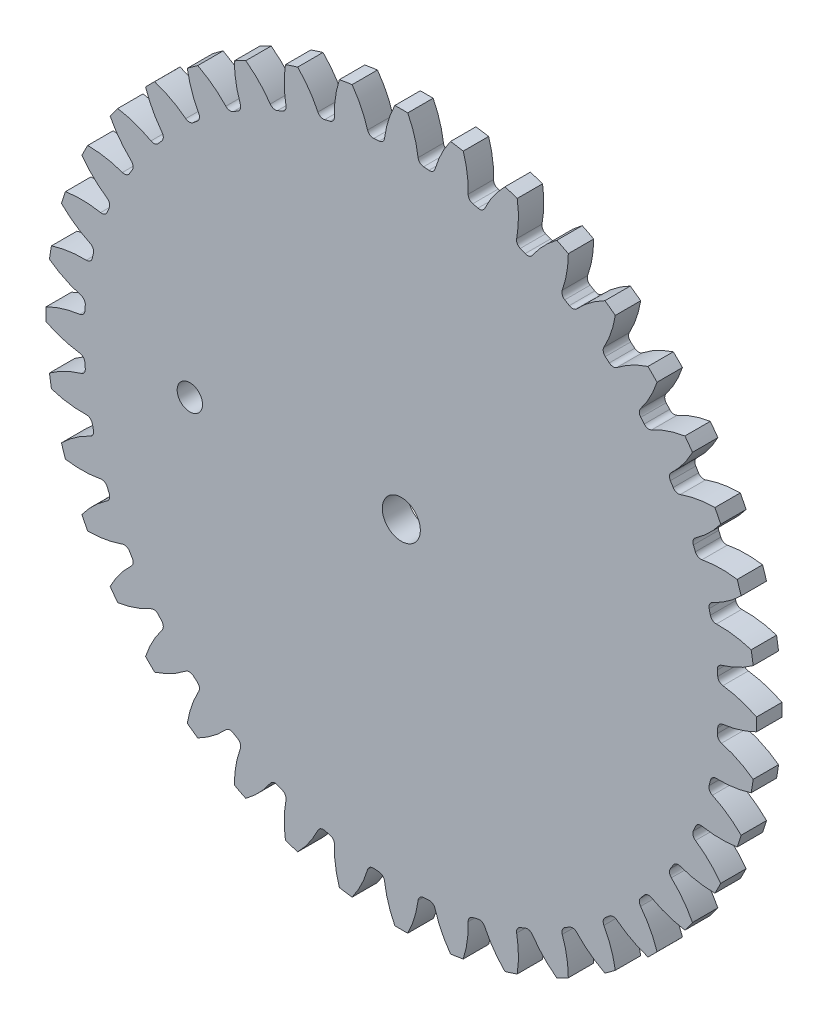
from build123d import *

# Parameters (mm, degrees)
BOSS_EXTRU_1_DEPTH                 = 6
CONG_1_R                           = 1.4
R_P_TITION_CIRCULAIRE4_COUNT       = 40
CONG_1_OF_R_P_TITION_CIRCULAIRE4_R = 1.4
ESQUISSE6_R                        = 4.5
ENL_V_MAT_EXTRU_1_DEPTH            = 119.945365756
ESQUISSE7_R                        = 3
ENL_V_MAT_EXTRU_2_DEPTH            = 119.945365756


with BuildPart() as part:
    # Esquisse3 → Boss.-Extru.1 (new body)
    with BuildSketch(Plane.XY):
        with BuildLine():
            Line((-5.88443218, 74.76880003), (0, 0))
            Line((0, 0), (5.88443218, 74.76880003))
            ThreePointArc((5.88443218, 74.76880003), (4.985176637, 74.834136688), (4.085200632, 74.888658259))
            ThreePointArc((4.085200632, 74.888658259), (3.249742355, 79.563282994), (1.521245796, 83.986223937))
            ThreePointArc((1.521245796, 83.986223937), (0, 84), (-1.521245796, 83.986223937))
            ThreePointArc((-1.521245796, 83.986223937), (-3.249742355, 79.563282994), (-4.085200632, 74.888658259))
            ThreePointArc((-4.085200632, 74.888658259), (-4.985176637, 74.834136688), (-5.88443218, 74.76880003))
        make_face()
    boss_extru_1 = extrude(amount=BOSS_EXTRU_1_DEPTH)

    # Cong_1
    cong_1_edges = [part.edges().sort_by_distance(p)[0] for p in [
        (-4.085200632, 74.888658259, 3),
        (4.085200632, 74.888658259, 3),
    ]]
    fillet(cong_1_edges, radius=CONG_1_R)

    # R_p_tition circulaire4: Boss.-Extru.1 ×40 about axis
    r_p_tition_circulaire4_axis = Axis((0, 0, 0), (0, 0, 1))
    for i in range(1, R_P_TITION_CIRCULAIRE4_COUNT):
        add(boss_extru_1.rotate(r_p_tition_circulaire4_axis, i * 360 / R_P_TITION_CIRCULAIRE4_COUNT))

    # Cong_1 of R_p_tition circulaire4
    cong_1_of_r_p_tition_circulaire4_edges = [part.edges().sort_by_distance(p)[0] for p in [
        (-15.750072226, 73.32758843, 3),
        (-7.680262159, 74.60572078, 3),
        (-27.027124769, 69.960950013, 3),
        (-19.256611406, 72.485742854, 3),
        (-37.638679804, 64.87164082, 3),
        (-30.358798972, 68.580925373, 3),
        (-47.323445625, 58.184976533, 3),
        (-40.713452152, 62.987417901, 3),
        (-55.842951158, 50.065605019, 3),
        (-50.065605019, 55.842951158, 3),
        (-62.987417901, 40.713452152, 3),
        (-58.184976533, 47.323445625, 3),
        (-68.580925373, 30.358798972, 3),
        (-64.87164082, 37.638679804, 3),
        (-72.485742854, 19.256611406, 3),
        (-69.960950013, 27.027124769, 3),
        (-74.60572078, 7.680262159, 3),
        (-73.32758843, 15.750072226, 3),
        (-74.888658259, -4.085200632, 3),
        (-74.888658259, 4.085200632, 3),
        (-73.32758843, -15.750072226, 3),
        (-74.60572078, -7.680262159, 3),
        (-69.960950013, -27.027124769, 3),
        (-72.485742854, -19.256611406, 3),
        (-64.87164082, -37.638679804, 3),
        (-68.580925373, -30.358798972, 3),
        (-58.184976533, -47.323445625, 3),
        (-62.987417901, -40.713452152, 3),
        (-50.065605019, -55.842951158, 3),
        (-55.842951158, -50.065605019, 3),
        (-40.713452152, -62.987417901, 3),
        (-47.323445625, -58.184976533, 3),
        (-30.358798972, -68.580925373, 3),
        (-37.638679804, -64.87164082, 3),
        (-19.256611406, -72.485742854, 3),
        (-27.027124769, -69.960950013, 3),
        (-7.680262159, -74.60572078, 3),
        (-15.750072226, -73.32758843, 3),
        (4.085200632, -74.888658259, 3),
        (-4.085200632, -74.888658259, 3),
        (15.750072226, -73.32758843, 3),
        (7.680262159, -74.60572078, 3),
        (27.027124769, -69.960950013, 3),
        (19.256611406, -72.485742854, 3),
        (37.638679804, -64.87164082, 3),
        (30.358798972, -68.580925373, 3),
        (47.323445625, -58.184976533, 3),
        (40.713452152, -62.987417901, 3),
        (55.842951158, -50.065605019, 3),
        (50.065605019, -55.842951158, 3),
        (62.987417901, -40.713452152, 3),
        (58.184976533, -47.323445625, 3),
        (68.580925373, -30.358798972, 3),
        (64.87164082, -37.638679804, 3),
        (72.485742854, -19.256611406, 3),
        (69.960950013, -27.027124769, 3),
        (74.60572078, -7.680262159, 3),
        (73.32758843, -15.750072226, 3),
        (74.888658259, 4.085200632, 3),
        (74.888658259, -4.085200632, 3),
        (73.32758843, 15.750072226, 3),
        (74.60572078, 7.680262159, 3),
        (69.960950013, 27.027124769, 3),
        (72.485742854, 19.256611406, 3),
        (64.87164082, 37.638679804, 3),
        (68.580925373, 30.358798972, 3),
        (58.184976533, 47.323445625, 3),
        (62.987417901, 40.713452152, 3),
        (50.065605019, 55.842951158, 3),
        (55.842951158, 50.065605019, 3),
        (40.713452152, 62.987417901, 3),
        (47.323445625, 58.184976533, 3),
        (30.358798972, 68.580925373, 3),
        (37.638679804, 64.87164082, 3),
        (19.256611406, 72.485742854, 3),
        (27.027124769, 69.960950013, 3),
        (7.680262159, 74.60572078, 3),
        (15.750072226, 73.32758843, 3),
    ]]
    fillet(cong_1_of_r_p_tition_circulaire4_edges, radius=CONG_1_OF_R_P_TITION_CIRCULAIRE4_R)

    # Esquisse6 → Enl_v. mat.-Extru.1 (cut, through all)
    with BuildSketch(Plane.XY.offset(6)):
        Circle(ESQUISSE6_R)
    extrude(amount=-ENL_V_MAT_EXTRU_1_DEPTH, mode=Mode.SUBTRACT)

    # Esquisse7 → Enl_v. mat.-Extru.2 (cut, through all)
    with BuildSketch(Plane.XY.offset(6)):
        with Locations((-50, 0)):
            Circle(ESQUISSE7_R)
    extrude(amount=-ENL_V_MAT_EXTRU_2_DEPTH, mode=Mode.SUBTRACT)


solid = part.part
